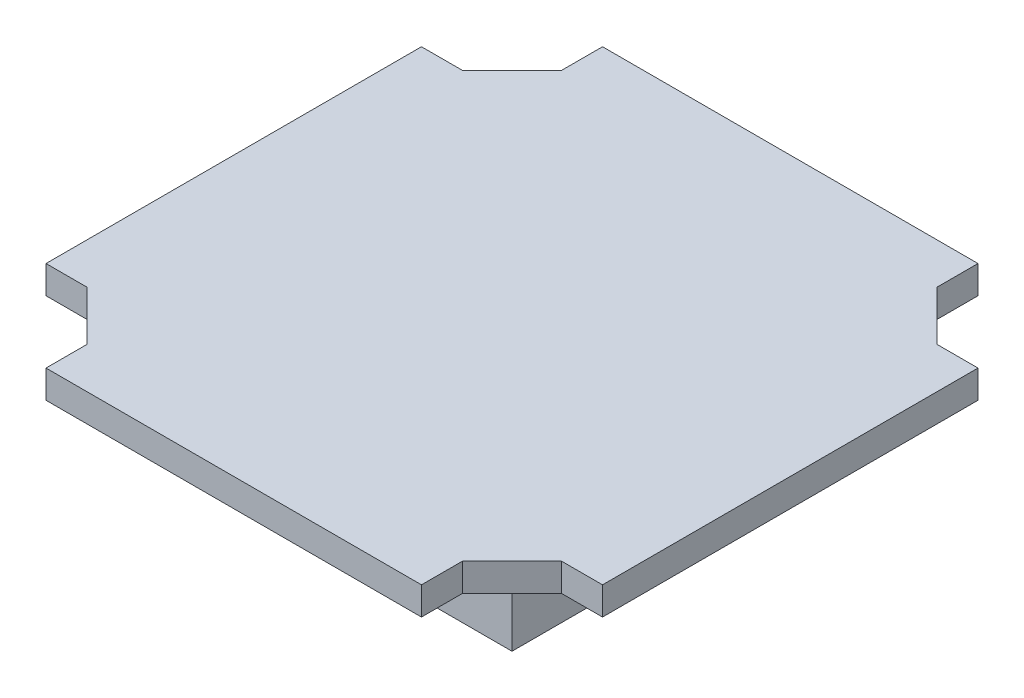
from build123d import *

# Parameters (mm, degrees)
BOSS_EXTRUDE1_DEPTH = 2.5
SKETCH1_3_W         = 33
SKETCH1_3_H         = 33
BOSS_EXTRUDE2_DEPTH = 7
SKETCH2_W           = 2
SKETCH2_H           = 12.5
SKETCH2_W_2         = 8.792893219
SKETCH2_H_2         = 2
SKETCH2_W_3         = 22
CUT_EXTRUDE1_DEPTH  = 0.25


with BuildPart() as part:
    # Sketch1 → Boss-Extrude1 (new body)
    with BuildSketch(Plane(origin=(0, 0, 0), x_dir=(1, 0, 0), z_dir=(0, 1, 0))):
        Polygon((16.799369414, 24.9), (-16.799369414, 24.9), (-16.799369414, 21.24), (-21.24, 16.799369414), (-24.9, 16.799369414), (-24.9, -16.799369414), (-21.24, -16.799369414), (-16.799369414, -21.24), (-16.799369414, -24.9), (16.799369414, -24.9), (16.799369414, -21.24), (21.24, -16.799369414), (24.9, -16.799369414), (24.9, 16.799369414), (21.24, 16.799369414), (16.799369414, 21.24), align=None)
    extrude(amount=BOSS_EXTRUDE1_DEPTH)

    # Sketch1_3 → Boss-Extrude2 (add)
    with BuildSketch(Plane(origin=(0, 0, 0), x_dir=(1, 0, 0), z_dir=(0, 1, 0))):
        Rectangle(SKETCH1_3_W, SKETCH1_3_H)
    extrude(amount=-BOSS_EXTRUDE2_DEPTH)

    # Sketch2 → Cut-Extrude1 (cut)
    with BuildSketch(Plane.XZ.offset(7)):
        Polygon((-12.727922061, -12.02081528), (12.02081528, 12.727922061), (12.727922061, 12.02081528), (-12.02081528, -12.727922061), align=None)
        with Locations((1, -6.25)):
            Rectangle(SKETCH2_W, SKETCH2_H)
        with Locations((5.103553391, -1)):
            Rectangle(SKETCH2_W_2, SKETCH2_H_2)
        with Locations((1.5, 2.5)):
            Rectangle(SKETCH2_W_3, SKETCH2_H_2)
        Polygon((9.5, 1), (9.5, -3), (12.5, -1), align=None)
        Polygon((-9.5, 4.5), (-9.5, 0.5), (-12.5, 2.5), align=None)
    extrude(amount=-CUT_EXTRUDE1_DEPTH, mode=Mode.SUBTRACT)


solid = part.part
